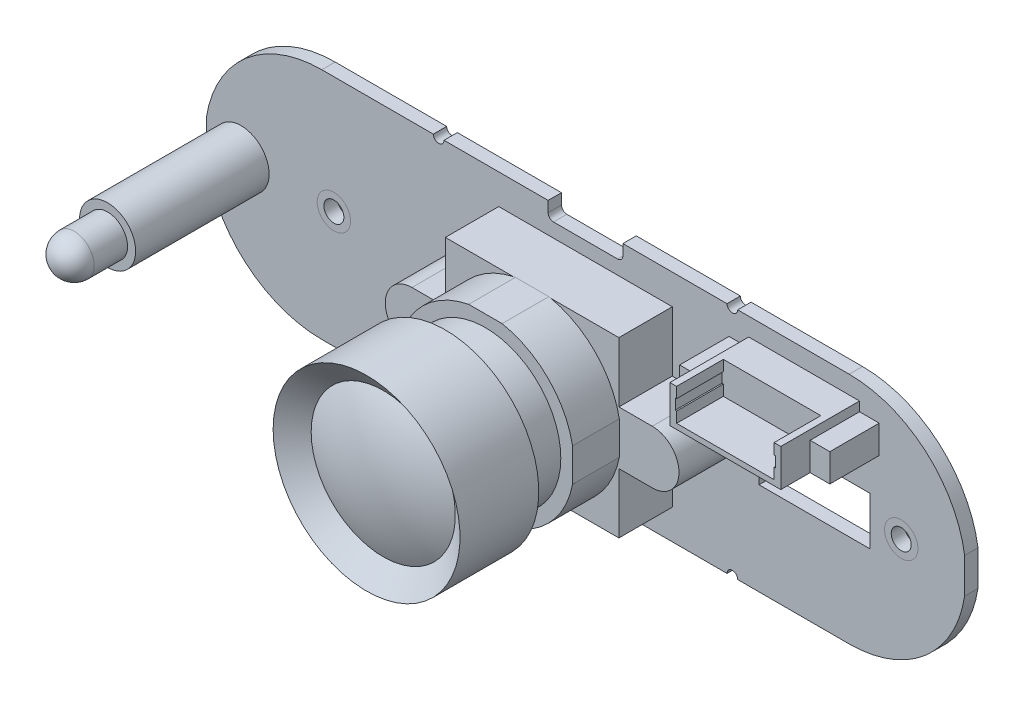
from build123d import *

# Parameters (mm, degrees)
BOSS_EXTRUDE1_DEPTH     = 0.5
CUT_EXTRUDE1_DEPTH      = 30.817151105
CUT_EXTRUDE1_DEPTH_BACK = 30.817151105
SKETCH2_W               = 2
SKETCH2_H               = 10
CUT_EXTRUDE2_DEPTH      = 30.721583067
CUT_EXTRUDE2_DEPTH_BACK = 30.721583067
SKETCH3_R               = 0.75
SKETCH3_W               = 8.3
SKETCH3_H               = 3.6
SKETCH4_R               = 2.1
BOSS_EXTRUDE2_DEPTH     = 10
SKETCH5_R               = 1.5
BOSS_EXTRUDE3_DEPTH     = 2.5
DOME1_FACE_RADIUS       = 1.5
DOME1_HEIGHT            = 1.5
SKETCH6_W               = 13
SKETCH6_H               = 4
SKETCH6_H_2             = 4.5
BOSS_EXTRUDE4_DEPTH     = 4
BOSS_EXTRUDE5_DEPTH     = 3.5
SKETCH8_R               = 5.65
BOSS_EXTRUDE6_DEPTH     = 3
BOSS_EXTRUDE7_DEPTH     = 3.7
SKETCH11_W              = 8.3
SKETCH11_H              = 2.8
BOSS_EXTRUDE8_DEPTH     = 2.2
CUT_EXTRUDE3_DEPTH      = 3.5
CUT_EXTRUDE4_REACH      = 35.942
SKETCH15_R              = 0.4


with BuildPart() as part:
    # Sketch1 → Boss-Extrude1 (new, symmetric)
    with BuildSketch(Plane.XY):
        with BuildLine():
            Line((-19.75, 8.75), (19.75, 8.75))
            ThreePointArc((19.75, 8.75), (28.5, 0), (19.75, -8.75))
            Line((19.75, -8.75), (-19.75, -8.75))
            ThreePointArc((-19.75, -8.75), (-28.5, 0), (-19.75, 8.75))
        make_face()
    extrude(amount=BOSS_EXTRUDE1_DEPTH, both=True)

    # Sketch2 → Cut-Extrude1 (cut, two sides: drawn at the far end of the back side and taken through both)
    with BuildSketch(Plane.XY.offset(-CUT_EXTRUDE1_DEPTH_BACK)):
        with Locations((29.4, 0)):
            Rectangle(SKETCH2_W, SKETCH2_H)
        with Locations((-29.4, 0)):
            Rectangle(SKETCH2_W, SKETCH2_H)
        with BuildLine():
            Line((2.4, 7.55), (-2.4, 7.55))
            ThreePointArc((-2.4, 7.55), (-2.682842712, 7.667157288), (-2.8, 7.95))
            Line((-2.8, 7.95), (-2.8, 9.95))
            Line((-2.8, 9.95), (2.8, 9.95))
            Line((2.8, 9.95), (2.8, 7.95))
            ThreePointArc((2.8, 7.95), (2.682842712, 7.667157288), (2.4, 7.55))
        make_face()
    extrude(amount=CUT_EXTRUDE1_DEPTH + CUT_EXTRUDE1_DEPTH_BACK, mode=Mode.SUBTRACT)

    # Sketch3 → Cut-Extrude2 (cut, two sides: drawn at the far end of the back side and taken through both)
    with BuildSketch(Plane.XY.offset(-CUT_EXTRUDE2_DEPTH_BACK)):
        with Locations((23.65, 0)):
            Circle(SKETCH3_R)
        with Locations((-18.85, 0)):
            Circle(SKETCH3_R)
        with Locations((17.15, 0)):
            Rectangle(SKETCH3_W, SKETCH3_H)
    extrude(amount=CUT_EXTRUDE2_DEPTH + CUT_EXTRUDE2_DEPTH_BACK, mode=Mode.SUBTRACT)

    # Sketch4 → Boss-Extrude2 (add)
    with BuildSketch(Plane.XY.offset(0.5)):
        with Locations((-25.8, 0)):
            Circle(SKETCH4_R)
    extrude(amount=BOSS_EXTRUDE2_DEPTH)

    # Sketch5 → Boss-Extrude3 (add)
    with BuildSketch(Plane.XY.offset(10.5)):
        with Locations((-25.8, 0)):
            Circle(SKETCH5_R)
    extrude(amount=BOSS_EXTRUDE3_DEPTH)

    # Dome1: a dome of height H over a round flat face of radius A is a cap of a sphere of radius (A * A + H * H) / (2 * H)
    dome1_r = (DOME1_FACE_RADIUS * DOME1_FACE_RADIUS + DOME1_HEIGHT * DOME1_HEIGHT) / (2 * DOME1_HEIGHT)
    dome1_base = Plane((-25.8, 0, 13), z_dir=(0, 0, 1))
    with Locations(dome1_base.offset(DOME1_HEIGHT - dome1_r)):
        dome1_ball = Sphere(dome1_r, mode=Mode.PRIVATE)
    add(split(dome1_ball, bisect_by=dome1_base, keep=Keep.TOP, mode=Mode.PRIVATE))

    # Sketch6 → Boss-Extrude4 (add)
    with BuildSketch(Plane.XY.offset(0.5)):
        with BuildLine():
            Line((-6.5, -2), (-6.5, 2))
            Line((-6.5, 2), (-9, 2))
            ThreePointArc((-9, 2), (-11, 0), (-9, -2))
            Line((-9, -2), (-6.5, -2))
        make_face()
        Rectangle(SKETCH6_W, SKETCH6_H)
        with BuildLine():
            Line((9, 2), (6.5, 2))
            Line((6.5, 2), (6.5, -2))
            Line((6.5, -2), (9, -2))
            ThreePointArc((9, -2), (11, 0), (9, 2))
        make_face()
        with Locations((0, -4.25)):
            Rectangle(SKETCH6_W, SKETCH6_H_2)
        with Locations((0, 4.25)):
            Rectangle(SKETCH6_W, SKETCH6_H_2)
    extrude(amount=BOSS_EXTRUDE4_DEPTH)

    # Sketch7 → Boss-Extrude5 (add)
    with BuildSketch(Plane.XY.offset(4.5)):
        with BuildLine():
            Line((6.531462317, 1.25), (6.531462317, -1.25))
            ThreePointArc((6.531462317, -1.25), (4.702260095, -4.702260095), (1.25, -6.531462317))
            Line((1.25, -6.531462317), (-1.25, -6.531462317))
            ThreePointArc((-1.25, -6.531462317), (-4.702260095, -4.702260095), (-6.531462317, -1.25))
            Line((-6.531462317, -1.25), (-6.531462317, 1.25))
            ThreePointArc((-6.531462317, 1.25), (-4.702260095, 4.702260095), (-1.25, 6.531462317))
            Line((-1.25, 6.531462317), (1.25, 6.531462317))
            ThreePointArc((1.25, 6.531462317), (4.702260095, 4.702260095), (6.531462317, 1.25))
        make_face()
    extrude(amount=BOSS_EXTRUDE5_DEPTH)

    # Sketch8 → Boss-Extrude6 (add)
    with BuildSketch(Plane.XY.offset(8)):
        Circle(SKETCH8_R)
    extrude(amount=BOSS_EXTRUDE6_DEPTH)

    # Sketch9 → Revolve1 (revolve)
    with BuildSketch(Plane(origin=(0, 0, 0), x_dir=(1, 0, 0), z_dir=(0, 1, 0)), mode=Mode.PRIVATE) as revolve1_sk:
        with BuildLine():
            Line((0, -11), (7, -11))
            Line((7, -11), (7, -16.9))
            Line((7, -16.9), (5.4, -15.65))
            ThreePointArc((5.4, -15.65), (2.771394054, -16.583422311), (0, -16.9))
            Line((0, -16.9), (0, -11))
        make_face()
    revolve(revolve1_sk.sketch.rotate(Axis((0, 0, 0.5), (0, 0, 1)), 180), axis=Axis((0, 0, 0.5), (0, 0, 1)))

    # Sketch10 → Boss-Extrude7 (add)
    with BuildSketch(Plane.XY.offset(0.5)):
        Polygon((10.75, 4.6), (22, 4.6), (22, 6.7), (20.525, 6.7), (20.525, 7.4), (12.225, 7.4), (12.225, 6.7), (10.75, 6.7), align=None)
    extrude(amount=BOSS_EXTRUDE7_DEPTH)

    # Sketch11 → Boss-Extrude8 (add)
    with BuildSketch(Plane.XY.offset(4.2)):
        with Locations((16.375, 6)):
            Rectangle(SKETCH11_W, SKETCH11_H)
    extrude(amount=BOSS_EXTRUDE8_DEPTH)

    # Sketch12 → Cut-Extrude3 (cut)
    with BuildSketch(Plane.XY.offset(6.4)):
        Polygon((20.025, 7.4), (20.025, 6.6), (20.125, 6.6), (20.125, 5.8), (20.025, 5.8), (20.025, 5), (12.725, 5), (12.725, 5.8), (12.625, 5.8), (12.625, 6.6), (12.725, 6.6), (12.725, 7.4), align=None)
    extrude(amount=-CUT_EXTRUDE3_DEPTH, mode=Mode.SUBTRACT)

    # Sketch15 → Cut-Extrude4 (cut, up to next)
    with BuildSketch(Plane.XY.offset(0.5), mode=Mode.PRIVATE) as cut_extrude4_sk1:
        with Locations((11, 8.75)):
            Circle(SKETCH15_R)
    cut_extrude4_tool1 = extrude(cut_extrude4_sk1.sketch, amount=-CUT_EXTRUDE4_REACH, mode=Mode.PRIVATE) & part.part
    # Sketch15 → Cut-Extrude4 (cut, up to next)
    with BuildSketch(Plane.XY.offset(0.5), mode=Mode.PRIVATE) as cut_extrude4_sk2:
        with Locations((-11, 8.75)):
            Circle(SKETCH15_R)
    cut_extrude4_tool2 = extrude(cut_extrude4_sk2.sketch, amount=-CUT_EXTRUDE4_REACH, mode=Mode.PRIVATE) & part.part
    # Sketch15 → Cut-Extrude4 (cut, up to next)
    with BuildSketch(Plane.XY.offset(0.5), mode=Mode.PRIVATE) as cut_extrude4_sk3:
        with Locations((-11, -8.75)):
            Circle(SKETCH15_R)
    cut_extrude4_tool3 = extrude(cut_extrude4_sk3.sketch, amount=-CUT_EXTRUDE4_REACH, mode=Mode.PRIVATE) & part.part
    # Sketch15 → Cut-Extrude4 (cut, up to next)
    with BuildSketch(Plane.XY.offset(0.5), mode=Mode.PRIVATE) as cut_extrude4_sk4:
        with Locations((11, -8.75)):
            Circle(SKETCH15_R)
    cut_extrude4_tool4 = extrude(cut_extrude4_sk4.sketch, amount=-CUT_EXTRUDE4_REACH, mode=Mode.PRIVATE) & part.part
    add(cut_extrude4_tool1.solids().sort_by_distance((11, 8.75, 0.5))[0], mode=Mode.SUBTRACT)
    add(cut_extrude4_tool2.solids().sort_by_distance((-11, 8.75, 0.5))[0], mode=Mode.SUBTRACT)
    add(cut_extrude4_tool3.solids().sort_by_distance((-11, -8.75, 0.5))[0], mode=Mode.SUBTRACT)
    add(cut_extrude4_tool4.solids().sort_by_distance((11, -8.75, 0.5))[0], mode=Mode.SUBTRACT)


solid = part.part
